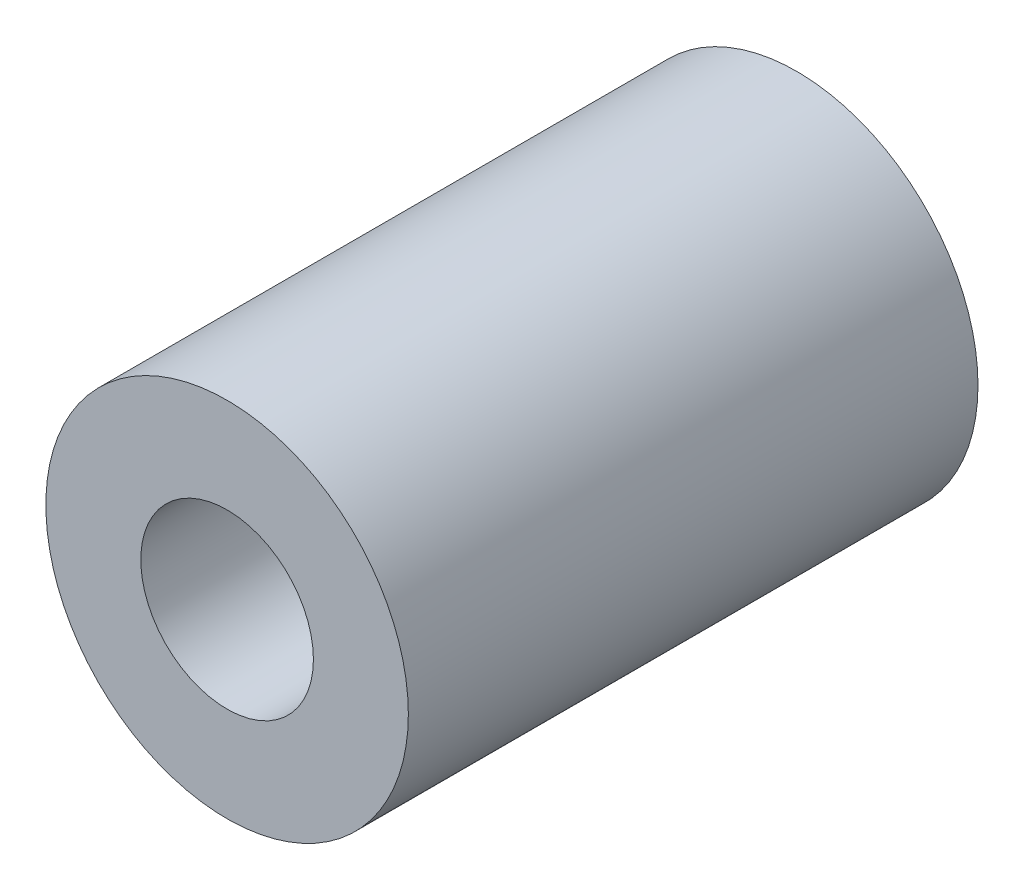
from build123d import *

# Parameters (mm, degrees)
ESQUISSE1_R        = 10.5
ESQUISSE1_R_2      = 5
BOSS_EXTRU_1_DEPTH = 33


with BuildPart() as part:
    # Esquisse1 → Boss.-Extru.1 (new body)
    with BuildSketch(Plane.XY):
        Circle(ESQUISSE1_R)
        Circle(ESQUISSE1_R_2, mode=Mode.SUBTRACT)
    extrude(amount=BOSS_EXTRU_1_DEPTH)


solid = part.part
